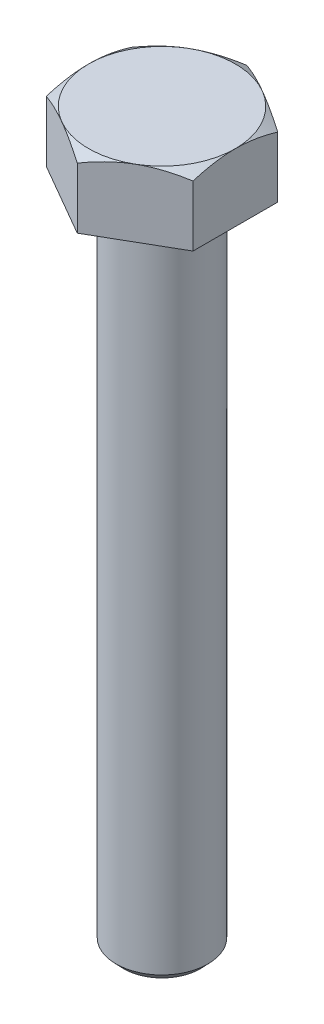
from build123d import *

# Parameters (mm, degrees)
SKETCH3_OUTSIDE_W  = 31.386
SKETCH3_OUTSIDE_H  = 31.386
CUT_EXTRUDE1_DEPTH = 67.125051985


with BuildPart() as part:
    # Sketch1 → Base-Revolve (revolve)
    with BuildSketch(Plane.XY, mode=Mode.PRIVATE) as base_revolve_sk:
        Polygon((0, 0), (8, 0), (8, 4.85), (6.35, 5.842), (0, 5.842), align=None)
    revolve(base_revolve_sk.sketch.rotate(Axis((0, 0, 0), (0, 1, 0)), 90), axis=Axis((0, 0, 0), (0, 1, 0)))

    # Sketch2 → Boss-Revolve1 (revolve)
    with BuildSketch(Plane.XY, mode=Mode.PRIVATE) as boss_revolve1_sk:
        Polygon((0, -57.15), (3.3095, -57.15), (3.96875, -56.4595), (3.96875, 0), (0, 0), align=None)
    revolve(boss_revolve1_sk.sketch.rotate(Axis((0, 0, 0), (0, 1, 0)), 90), axis=Axis((0, 0, 0), (0, 1, 0)))

    # Sketch3 outside → Cut-Extrude1 (cut, through all)
    with BuildSketch(Plane(origin=(0, 8, 0), x_dir=(-1, 0, 0), z_dir=(0, 1, 0))):
        Rectangle(SKETCH3_OUTSIDE_W, SKETCH3_OUTSIDE_H)
        Polygon((6.35, 3.666174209), (0, 7.332348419), (-6.35, 3.666174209), (-6.35, -3.666174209), (0, -7.332348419), (6.35, -3.666174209), align=None, mode=Mode.SUBTRACT)
    extrude(amount=-CUT_EXTRUDE1_DEPTH, mode=Mode.SUBTRACT)


solid = part.part
